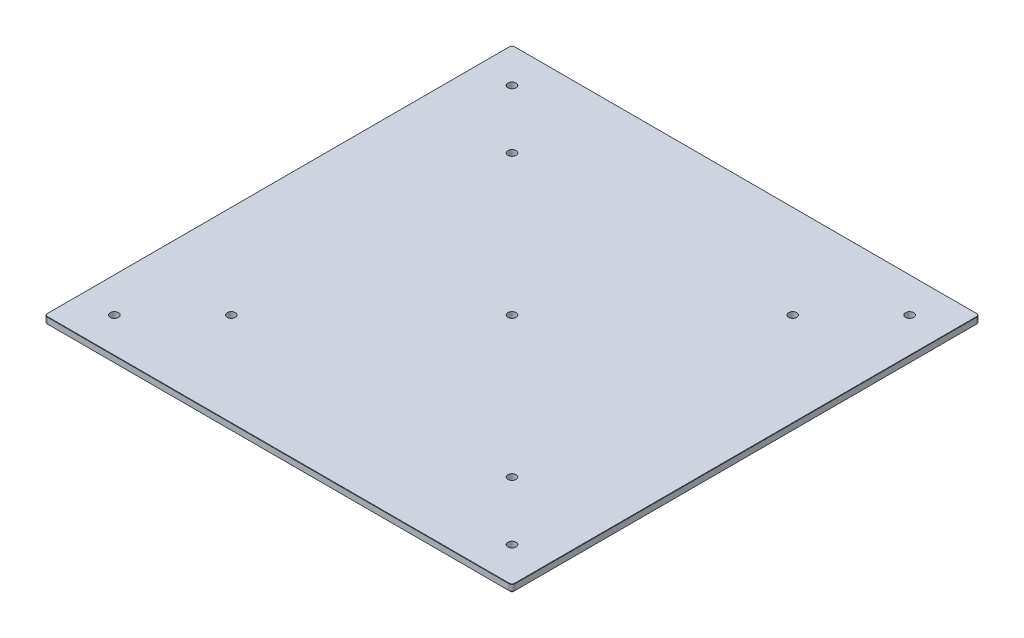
ISO-10303-21;
HEADER;
FILE_DESCRIPTION(('STEP AP214'),'2;1');
FILE_NAME('part.step','',(''),(''),'','','');
FILE_SCHEMA(('AUTOMOTIVE_DESIGN { 1 0 10303 214 1 1 1 1 }'));
ENDSEC;
DATA;
#1=APPLICATION_CONTEXT('core data for automotive mechanical design processes');
#2=APPLICATION_PROTOCOL_DEFINITION('international standard','automotive_design',2000,#1);
#3=PRODUCT_CONTEXT('',#1,'mechanical');
#4=PRODUCT('Part','Part','',(#3));
#5=PRODUCT_RELATED_PRODUCT_CATEGORY('part','',(#4));
#6=PRODUCT_DEFINITION_FORMATION('','',#4);
#7=PRODUCT_DEFINITION_CONTEXT('part definition',#1,'design');
#8=PRODUCT_DEFINITION('design','',#6,#7);
#9=PRODUCT_DEFINITION_SHAPE('','',#8);
#10=(LENGTH_UNIT() NAMED_UNIT(*) SI_UNIT(.MILLI.,.METRE.));
#11=(NAMED_UNIT(*) PLANE_ANGLE_UNIT() SI_UNIT($,.RADIAN.));
#12=(NAMED_UNIT(*) SI_UNIT($,.STERADIAN.) SOLID_ANGLE_UNIT());
#13=UNCERTAINTY_MEASURE_WITH_UNIT(LENGTH_MEASURE(1.E-05),#10,'distance_accuracy_value','');
#14=(GEOMETRIC_REPRESENTATION_CONTEXT(3) GLOBAL_UNCERTAINTY_ASSIGNED_CONTEXT((#13)) GLOBAL_UNIT_ASSIGNED_CONTEXT((#10,
#11,#12)) REPRESENTATION_CONTEXT('',''));
#15=CARTESIAN_POINT('',(0.,0.,0.));
#16=DIRECTION('',(0.,0.,1.));
#17=DIRECTION('',(1.,0.,0.));
#18=AXIS2_PLACEMENT_3D('',#15,#16,#17);
#19=CARTESIAN_POINT('',(190.5,-6.35,-190.5));
#20=DIRECTION('',(0.,-1.,0.));
#21=DIRECTION('',(0.,0.,-1.));
#22=AXIS2_PLACEMENT_3D('',#19,#20,#21);
#23=PLANE('',#22);
#24=CARTESIAN_POINT('',(-161.925,-6.35,-161.925));
#25=DIRECTION('',(0.,1.,0.));
#26=DIRECTION('',(0.,0.,1.));
#27=AXIS2_PLACEMENT_3D('',#24,#25,#26);
#28=CIRCLE('',#27,3.3782);
#29=CARTESIAN_POINT('',(-161.925,-6.35,-158.5468));
#30=VERTEX_POINT('',#29);
#31=EDGE_CURVE('E724',#30,#30,#28,.T.);
#32=ORIENTED_EDGE('',*,*,#31,.T.);
#33=EDGE_LOOP('',(#32));
#34=FACE_BOUND('',#33,.T.);
#35=CARTESIAN_POINT('',(161.925,-6.35,-161.925));
#36=DIRECTION('',(0.,1.,0.));
#37=DIRECTION('',(0.,0.,1.));
#38=AXIS2_PLACEMENT_3D('',#35,#36,#37);
#39=CIRCLE('',#38,3.3782);
#40=CARTESIAN_POINT('',(161.925,-6.35,-158.5468));
#41=VERTEX_POINT('',#40);
#42=EDGE_CURVE('E716',#41,#41,#39,.T.);
#43=ORIENTED_EDGE('',*,*,#42,.T.);
#44=EDGE_LOOP('',(#43));
#45=FACE_BOUND('',#44,.T.);
#46=CARTESIAN_POINT('',(-187.96,-6.35,-187.96));
#47=DIRECTION('',(0.,-1.,0.));
#48=DIRECTION('',(0.,0.,-1.));
#49=AXIS2_PLACEMENT_3D('',#46,#47,#48);
#50=CIRCLE('',#49,1.27000000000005);
#51=CARTESIAN_POINT('',(-189.23,-6.35,-187.96));
#52=VERTEX_POINT('',#51);
#53=CARTESIAN_POINT('',(-187.96,-6.35,-189.23));
#54=VERTEX_POINT('',#53);
#55=EDGE_CURVE('E202',#52,#54,#50,.T.);
#56=ORIENTED_EDGE('',*,*,#55,.T.);
#57=DIRECTION('',(1.,0.,0.));
#58=VECTOR('',#57,1.);
#59=CARTESIAN_POINT('',(190.5,-6.35,-189.23));
#60=LINE('',#59,#58);
#61=CARTESIAN_POINT('',(187.96,-6.35,-189.23));
#62=VERTEX_POINT('',#61);
#63=EDGE_CURVE('E204',#54,#62,#60,.T.);
#64=ORIENTED_EDGE('',*,*,#63,.T.);
#65=CARTESIAN_POINT('',(187.96,-6.35,-187.96));
#66=DIRECTION('',(0.,-1.,0.));
#67=DIRECTION('',(0.,0.,-1.));
#68=AXIS2_PLACEMENT_3D('',#65,#66,#67);
#69=CIRCLE('',#68,1.27000000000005);
#70=CARTESIAN_POINT('',(189.23,-6.35,-187.96));
#71=VERTEX_POINT('',#70);
#72=EDGE_CURVE('E176',#62,#71,#69,.T.);
#73=ORIENTED_EDGE('',*,*,#72,.T.);
#74=DIRECTION('',(0.,0.,1.));
#75=VECTOR('',#74,1.);
#76=CARTESIAN_POINT('',(189.23,-6.35,-190.5));
#77=LINE('',#76,#75);
#78=CARTESIAN_POINT('',(189.23,-6.35,187.96));
#79=VERTEX_POINT('',#78);
#80=EDGE_CURVE('E197',#71,#79,#77,.T.);
#81=ORIENTED_EDGE('',*,*,#80,.T.);
#82=CARTESIAN_POINT('',(187.96,-6.35,187.96));
#83=DIRECTION('',(0.,-1.,0.));
#84=DIRECTION('',(0.,0.,-1.));
#85=AXIS2_PLACEMENT_3D('',#82,#83,#84);
#86=CIRCLE('',#85,1.27000000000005);
#87=CARTESIAN_POINT('',(187.96,-6.35,189.23));
#88=VERTEX_POINT('',#87);
#89=EDGE_CURVE('E189',#79,#88,#86,.T.);
#90=ORIENTED_EDGE('',*,*,#89,.T.);
#91=DIRECTION('',(-1.,0.,0.));
#92=VECTOR('',#91,1.);
#93=CARTESIAN_POINT('',(190.5,-6.35,189.23));
#94=LINE('',#93,#92);
#95=CARTESIAN_POINT('',(-187.96,-6.35,189.23));
#96=VERTEX_POINT('',#95);
#97=EDGE_CURVE('E186',#88,#96,#94,.T.);
#98=ORIENTED_EDGE('',*,*,#97,.T.);
#99=CARTESIAN_POINT('',(-187.96,-6.35,187.96));
#100=DIRECTION('',(0.,-1.,0.));
#101=DIRECTION('',(0.,0.,-1.));
#102=AXIS2_PLACEMENT_3D('',#99,#100,#101);
#103=CIRCLE('',#102,1.27000000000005);
#104=CARTESIAN_POINT('',(-189.23,-6.35,187.96));
#105=VERTEX_POINT('',#104);
#106=EDGE_CURVE('E195',#96,#105,#103,.T.);
#107=ORIENTED_EDGE('',*,*,#106,.T.);
#108=DIRECTION('',(0.,0.,-1.));
#109=VECTOR('',#108,1.);
#110=CARTESIAN_POINT('',(-189.23,-6.35,-190.5));
#111=LINE('',#110,#109);
#112=EDGE_CURVE('E199',#105,#52,#111,.T.);
#113=ORIENTED_EDGE('',*,*,#112,.T.);
#114=EDGE_LOOP('',(#56,#64,#73,#81,#90,#98,#107,#113));
#115=FACE_BOUND('',#114,.T.);
#116=CARTESIAN_POINT('',(0.,-6.35,0.));
#117=DIRECTION('',(0.,-1.,0.));
#118=DIRECTION('',(0.,0.,-1.));
#119=AXIS2_PLACEMENT_3D('',#116,#117,#118);
#120=CIRCLE('',#119,3.3782);
#121=CARTESIAN_POINT('',(0.,-6.35,-3.3782));
#122=VERTEX_POINT('',#121);
#123=EDGE_CURVE('E322',#122,#122,#120,.T.);
#124=ORIENTED_EDGE('',*,*,#123,.F.);
#125=EDGE_LOOP('',(#124));
#126=FACE_BOUND('',#125,.T.);
#127=CARTESIAN_POINT('',(-114.3,-6.35,-114.3));
#128=DIRECTION('',(0.,-1.,0.));
#129=DIRECTION('',(0.,0.,-1.));
#130=AXIS2_PLACEMENT_3D('',#127,#128,#129);
#131=CIRCLE('',#130,3.3782);
#132=CARTESIAN_POINT('',(-114.3,-6.35,-117.6782));
#133=VERTEX_POINT('',#132);
#134=EDGE_CURVE('E316',#133,#133,#131,.T.);
#135=ORIENTED_EDGE('',*,*,#134,.F.);
#136=EDGE_LOOP('',(#135));
#137=FACE_BOUND('',#136,.T.);
#138=CARTESIAN_POINT('',(-114.3,-6.35,114.3));
#139=DIRECTION('',(0.,-1.,0.));
#140=DIRECTION('',(0.,0.,-1.));
#141=AXIS2_PLACEMENT_3D('',#138,#139,#140);
#142=CIRCLE('',#141,3.3782);
#143=CARTESIAN_POINT('',(-114.3,-6.35,110.9218));
#144=VERTEX_POINT('',#143);
#145=EDGE_CURVE('E310',#144,#144,#142,.T.);
#146=ORIENTED_EDGE('',*,*,#145,.F.);
#147=EDGE_LOOP('',(#146));
#148=FACE_BOUND('',#147,.T.);
#149=CARTESIAN_POINT('',(114.3,-6.35,-114.3));
#150=DIRECTION('',(0.,-1.,0.));
#151=DIRECTION('',(0.,0.,-1.));
#152=AXIS2_PLACEMENT_3D('',#149,#150,#151);
#153=CIRCLE('',#152,3.3782);
#154=CARTESIAN_POINT('',(114.3,-6.35,-117.6782));
#155=VERTEX_POINT('',#154);
#156=EDGE_CURVE('E300',#155,#155,#153,.T.);
#157=ORIENTED_EDGE('',*,*,#156,.F.);
#158=EDGE_LOOP('',(#157));
#159=FACE_BOUND('',#158,.T.);
#160=CARTESIAN_POINT('',(114.3,-6.35,114.3));
#161=DIRECTION('',(0.,-1.,0.));
#162=DIRECTION('',(0.,0.,-1.));
#163=AXIS2_PLACEMENT_3D('',#160,#161,#162);
#164=CIRCLE('',#163,3.3782);
#165=CARTESIAN_POINT('',(114.3,-6.35,110.9218));
#166=VERTEX_POINT('',#165);
#167=EDGE_CURVE('E290',#166,#166,#164,.T.);
#168=ORIENTED_EDGE('',*,*,#167,.F.);
#169=EDGE_LOOP('',(#168));
#170=FACE_BOUND('',#169,.T.);
#171=CARTESIAN_POINT('',(-161.925,-6.35,161.925));
#172=DIRECTION('',(0.,1.,0.));
#173=DIRECTION('',(0.,0.,1.));
#174=AXIS2_PLACEMENT_3D('',#171,#172,#173);
#175=CIRCLE('',#174,3.3782);
#176=CARTESIAN_POINT('',(-161.925,-6.35,165.3032));
#177=VERTEX_POINT('',#176);
#178=EDGE_CURVE('E270',#177,#177,#175,.T.);
#179=ORIENTED_EDGE('',*,*,#178,.T.);
#180=EDGE_LOOP('',(#179));
#181=FACE_BOUND('',#180,.T.);
#182=CARTESIAN_POINT('',(161.925,-6.35,161.925));
#183=DIRECTION('',(0.,1.,0.));
#184=DIRECTION('',(0.,0.,1.));
#185=AXIS2_PLACEMENT_3D('',#182,#183,#184);
#186=CIRCLE('',#185,3.3782);
#187=CARTESIAN_POINT('',(161.925,-6.35,165.3032));
#188=VERTEX_POINT('',#187);
#189=EDGE_CURVE('E710',#188,#188,#186,.T.);
#190=ORIENTED_EDGE('',*,*,#189,.T.);
#191=EDGE_LOOP('',(#190));
#192=FACE_BOUND('',#191,.T.);
#193=ADVANCED_FACE('F32',(#34,#45,#115,#126,#137,#148,#159,#170,#181,#192),#23,.T.);
#194=CARTESIAN_POINT('',(190.5,-6.35,190.5));
#195=DIRECTION('',(1.,0.,0.));
#196=DIRECTION('',(0.,0.,-1.));
#197=AXIS2_PLACEMENT_3D('',#194,#195,#196);
#198=PLANE('',#197);
#199=DIRECTION('',(0.,1.,0.));
#200=VECTOR('',#199,1.);
#201=CARTESIAN_POINT('',(190.5,-6.35,-187.96));
#202=LINE('',#201,#200);
#203=CARTESIAN_POINT('',(190.5,-5.08000000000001,-187.96));
#204=VERTEX_POINT('',#203);
#205=CARTESIAN_POINT('',(190.5,-0.254000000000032,-187.96));
#206=VERTEX_POINT('',#205);
#207=EDGE_CURVE('E166',#204,#206,#202,.T.);
#208=ORIENTED_EDGE('',*,*,#207,.T.);
#209=DIRECTION('',(0.,0.,1.));
#210=VECTOR('',#209,1.);
#211=CARTESIAN_POINT('',(190.5,-0.254000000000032,187.96));
#212=LINE('',#211,#210);
#213=CARTESIAN_POINT('',(190.5,-0.254000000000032,187.96));
#214=VERTEX_POINT('',#213);
#215=EDGE_CURVE('E262',#206,#214,#212,.T.);
#216=ORIENTED_EDGE('',*,*,#215,.T.);
#217=DIRECTION('',(0.,1.,0.));
#218=VECTOR('',#217,1.);
#219=CARTESIAN_POINT('',(190.5,-6.35,187.96));
#220=LINE('',#219,#218);
#221=CARTESIAN_POINT('',(190.5,-5.08000000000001,187.96));
#222=VERTEX_POINT('',#221);
#223=EDGE_CURVE('E331',#214,#222,#220,.F.);
#224=ORIENTED_EDGE('',*,*,#223,.T.);
#225=DIRECTION('',(0.,0.,-1.));
#226=VECTOR('',#225,1.);
#227=CARTESIAN_POINT('',(190.5,-5.08000000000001,190.5));
#228=LINE('',#227,#226);
#229=EDGE_CURVE('E209',#222,#204,#228,.T.);
#230=ORIENTED_EDGE('',*,*,#229,.T.);
#231=EDGE_LOOP('',(#208,#216,#224,#230));
#232=FACE_BOUND('',#231,.T.);
#233=ADVANCED_FACE('F366',(#232),#198,.T.);
#234=CARTESIAN_POINT('',(-190.5,-6.35,190.5));
#235=DIRECTION('',(0.,0.,1.));
#236=DIRECTION('',(1.,0.,0.));
#237=AXIS2_PLACEMENT_3D('',#234,#235,#236);
#238=PLANE('',#237);
#239=DIRECTION('',(0.,1.,0.));
#240=VECTOR('',#239,1.);
#241=CARTESIAN_POINT('',(187.96,-6.35,190.5));
#242=LINE('',#241,#240);
#243=CARTESIAN_POINT('',(187.96,-5.08000000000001,190.5));
#244=VERTEX_POINT('',#243);
#245=CARTESIAN_POINT('',(187.96,-0.254000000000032,190.5));
#246=VERTEX_POINT('',#245);
#247=EDGE_CURVE('E328',#244,#246,#242,.T.);
#248=ORIENTED_EDGE('',*,*,#247,.T.);
#249=DIRECTION('',(-1.,0.,0.));
#250=VECTOR('',#249,1.);
#251=CARTESIAN_POINT('',(-187.96,-0.254000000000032,190.5));
#252=LINE('',#251,#250);
#253=CARTESIAN_POINT('',(-187.96,-0.254000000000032,190.5));
#254=VERTEX_POINT('',#253);
#255=EDGE_CURVE('E11',#246,#254,#252,.T.);
#256=ORIENTED_EDGE('',*,*,#255,.T.);
#257=DIRECTION('',(0.,1.,0.));
#258=VECTOR('',#257,1.);
#259=CARTESIAN_POINT('',(-187.96,-6.35,190.5));
#260=LINE('',#259,#258);
#261=CARTESIAN_POINT('',(-187.96,-5.08000000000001,190.5));
#262=VERTEX_POINT('',#261);
#263=EDGE_CURVE('E238',#254,#262,#260,.F.);
#264=ORIENTED_EDGE('',*,*,#263,.T.);
#265=DIRECTION('',(1.,0.,0.));
#266=VECTOR('',#265,1.);
#267=CARTESIAN_POINT('',(-190.5,-5.08000000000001,190.5));
#268=LINE('',#267,#266);
#269=EDGE_CURVE('E217',#262,#244,#268,.T.);
#270=ORIENTED_EDGE('',*,*,#269,.T.);
#271=EDGE_LOOP('',(#248,#256,#264,#270));
#272=FACE_BOUND('',#271,.T.);
#273=ADVANCED_FACE('F393',(#272),#238,.T.);
#274=CARTESIAN_POINT('',(-190.5,-6.35,190.5));
#275=DIRECTION('',(-1.,0.,0.));
#276=DIRECTION('',(0.,0.,1.));
#277=AXIS2_PLACEMENT_3D('',#274,#275,#276);
#278=PLANE('',#277);
#279=DIRECTION('',(0.,1.,0.));
#280=VECTOR('',#279,1.);
#281=CARTESIAN_POINT('',(-190.5,-6.35,187.96));
#282=LINE('',#281,#280);
#283=CARTESIAN_POINT('',(-190.5,-5.08000000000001,187.96));
#284=VERTEX_POINT('',#283);
#285=CARTESIAN_POINT('',(-190.5,-0.254000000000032,187.96));
#286=VERTEX_POINT('',#285);
#287=EDGE_CURVE('E157',#284,#286,#282,.T.);
#288=ORIENTED_EDGE('',*,*,#287,.T.);
#289=DIRECTION('',(0.,0.,-1.));
#290=VECTOR('',#289,1.);
#291=CARTESIAN_POINT('',(-190.5,-0.254000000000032,-187.96));
#292=LINE('',#291,#290);
#293=CARTESIAN_POINT('',(-190.5,-0.254000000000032,-187.96));
#294=VERTEX_POINT('',#293);
#295=EDGE_CURVE('E260',#286,#294,#292,.T.);
#296=ORIENTED_EDGE('',*,*,#295,.T.);
#297=DIRECTION('',(0.,1.,0.));
#298=VECTOR('',#297,1.);
#299=CARTESIAN_POINT('',(-190.5,-6.35,-187.96));
#300=LINE('',#299,#298);
#301=CARTESIAN_POINT('',(-190.5,-5.08000000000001,-187.96));
#302=VERTEX_POINT('',#301);
#303=EDGE_CURVE('E187',#294,#302,#300,.F.);
#304=ORIENTED_EDGE('',*,*,#303,.T.);
#305=DIRECTION('',(0.,0.,1.));
#306=VECTOR('',#305,1.);
#307=CARTESIAN_POINT('',(-190.5,-5.08000000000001,190.5));
#308=LINE('',#307,#306);
#309=EDGE_CURVE('E170',#302,#284,#308,.T.);
#310=ORIENTED_EDGE('',*,*,#309,.T.);
#311=EDGE_LOOP('',(#288,#296,#304,#310));
#312=FACE_BOUND('',#311,.T.);
#313=ADVANCED_FACE('F337',(#312),#278,.T.);
#314=CARTESIAN_POINT('',(-190.5,-6.35,-190.5));
#315=DIRECTION('',(0.,0.,-1.));
#316=DIRECTION('',(-1.,0.,0.));
#317=AXIS2_PLACEMENT_3D('',#314,#315,#316);
#318=PLANE('',#317);
#319=DIRECTION('',(0.,1.,0.));
#320=VECTOR('',#319,1.);
#321=CARTESIAN_POINT('',(-187.96,-6.35,-190.5));
#322=LINE('',#321,#320);
#323=CARTESIAN_POINT('',(-187.96,-5.08000000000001,-190.5));
#324=VERTEX_POINT('',#323);
#325=CARTESIAN_POINT('',(-187.96,-0.254000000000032,-190.5));
#326=VERTEX_POINT('',#325);
#327=EDGE_CURVE('E158',#324,#326,#322,.T.);
#328=ORIENTED_EDGE('',*,*,#327,.T.);
#329=DIRECTION('',(1.,0.,0.));
#330=VECTOR('',#329,1.);
#331=CARTESIAN_POINT('',(187.96,-0.254000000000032,-190.5));
#332=LINE('',#331,#330);
#333=CARTESIAN_POINT('',(187.96,-0.254000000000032,-190.5));
#334=VERTEX_POINT('',#333);
#335=EDGE_CURVE('E155',#326,#334,#332,.T.);
#336=ORIENTED_EDGE('',*,*,#335,.T.);
#337=DIRECTION('',(0.,1.,0.));
#338=VECTOR('',#337,1.);
#339=CARTESIAN_POINT('',(187.96,-6.35,-190.5));
#340=LINE('',#339,#338);
#341=CARTESIAN_POINT('',(187.96,-5.08000000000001,-190.5));
#342=VERTEX_POINT('',#341);
#343=EDGE_CURVE('E147',#334,#342,#340,.F.);
#344=ORIENTED_EDGE('',*,*,#343,.T.);
#345=DIRECTION('',(-1.,0.,0.));
#346=VECTOR('',#345,1.);
#347=CARTESIAN_POINT('',(-190.5,-5.08000000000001,-190.5));
#348=LINE('',#347,#346);
#349=EDGE_CURVE('E152',#342,#324,#348,.T.);
#350=ORIENTED_EDGE('',*,*,#349,.T.);
#351=EDGE_LOOP('',(#328,#336,#344,#350));
#352=FACE_BOUND('',#351,.T.);
#353=ADVANCED_FACE('F150',(#352),#318,.T.);
#354=CARTESIAN_POINT('',(190.5,0.,-190.5));
#355=DIRECTION('',(0.,-1.,0.));
#356=DIRECTION('',(0.,0.,-1.));
#357=AXIS2_PLACEMENT_3D('',#354,#355,#356);
#358=PLANE('',#357);
#359=CARTESIAN_POINT('',(-161.925,0.,-161.925));
#360=DIRECTION('',(0.,1.,0.));
#361=DIRECTION('',(0.,0.,1.));
#362=AXIS2_PLACEMENT_3D('',#359,#360,#361);
#363=CIRCLE('',#362,3.3782);
#364=CARTESIAN_POINT('',(-161.925,0.,-158.5468));
#365=VERTEX_POINT('',#364);
#366=EDGE_CURVE('E726',#365,#365,#363,.T.);
#367=ORIENTED_EDGE('',*,*,#366,.F.);
#368=EDGE_LOOP('',(#367));
#369=FACE_BOUND('',#368,.T.);
#370=CARTESIAN_POINT('',(161.925,0.,-161.925));
#371=DIRECTION('',(0.,1.,0.));
#372=DIRECTION('',(0.,0.,1.));
#373=AXIS2_PLACEMENT_3D('',#370,#371,#372);
#374=CIRCLE('',#373,3.3782);
#375=CARTESIAN_POINT('',(161.925,0.,-158.5468));
#376=VERTEX_POINT('',#375);
#377=EDGE_CURVE('E721',#376,#376,#374,.T.);
#378=ORIENTED_EDGE('',*,*,#377,.F.);
#379=EDGE_LOOP('',(#378));
#380=FACE_BOUND('',#379,.T.);
#381=CARTESIAN_POINT('',(161.925,0.,161.925));
#382=DIRECTION('',(0.,1.,0.));
#383=DIRECTION('',(0.,0.,1.));
#384=AXIS2_PLACEMENT_3D('',#381,#382,#383);
#385=CIRCLE('',#384,3.3782);
#386=CARTESIAN_POINT('',(161.925,0.,165.3032));
#387=VERTEX_POINT('',#386);
#388=EDGE_CURVE('E712',#387,#387,#385,.T.);
#389=ORIENTED_EDGE('',*,*,#388,.F.);
#390=EDGE_LOOP('',(#389));
#391=FACE_BOUND('',#390,.T.);
#392=CARTESIAN_POINT('',(-161.925,0.,161.925));
#393=DIRECTION('',(0.,1.,0.));
#394=DIRECTION('',(0.,0.,1.));
#395=AXIS2_PLACEMENT_3D('',#392,#393,#394);
#396=CIRCLE('',#395,3.3782);
#397=CARTESIAN_POINT('',(-161.925,0.,165.3032));
#398=VERTEX_POINT('',#397);
#399=EDGE_CURVE('E711',#398,#398,#396,.T.);
#400=ORIENTED_EDGE('',*,*,#399,.F.);
#401=EDGE_LOOP('',(#400));
#402=FACE_BOUND('',#401,.T.);
#403=CARTESIAN_POINT('',(187.96,0.,-187.96));
#404=DIRECTION('',(0.,-1.,0.));
#405=DIRECTION('',(0.,0.,-1.));
#406=AXIS2_PLACEMENT_3D('',#403,#404,#405);
#407=CIRCLE('',#406,2.2859999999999);
#408=CARTESIAN_POINT('',(190.246,0.,-187.96));
#409=VERTEX_POINT('',#408);
#410=CARTESIAN_POINT('',(187.96,0.,-190.246));
#411=VERTEX_POINT('',#410);
#412=EDGE_CURVE('E248',#409,#411,#407,.F.);
#413=ORIENTED_EDGE('',*,*,#412,.T.);
#414=DIRECTION('',(-1.,0.,0.));
#415=VECTOR('',#414,1.);
#416=CARTESIAN_POINT('',(-187.96,0.,-190.246));
#417=LINE('',#416,#415);
#418=CARTESIAN_POINT('',(-187.96,0.,-190.246));
#419=VERTEX_POINT('',#418);
#420=EDGE_CURVE('E252',#411,#419,#417,.T.);
#421=ORIENTED_EDGE('',*,*,#420,.T.);
#422=CARTESIAN_POINT('',(-187.96,0.,-187.96));
#423=DIRECTION('',(0.,-1.,0.));
#424=DIRECTION('',(0.,0.,-1.));
#425=AXIS2_PLACEMENT_3D('',#422,#423,#424);
#426=CIRCLE('',#425,2.2859999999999);
#427=CARTESIAN_POINT('',(-190.246,0.,-187.96));
#428=VERTEX_POINT('',#427);
#429=EDGE_CURVE('E250',#419,#428,#426,.F.);
#430=ORIENTED_EDGE('',*,*,#429,.T.);
#431=DIRECTION('',(0.,0.,1.));
#432=VECTOR('',#431,1.);
#433=CARTESIAN_POINT('',(-190.246,0.,187.96));
#434=LINE('',#433,#432);
#435=CARTESIAN_POINT('',(-190.246,0.,187.96));
#436=VERTEX_POINT('',#435);
#437=EDGE_CURVE('E246',#428,#436,#434,.T.);
#438=ORIENTED_EDGE('',*,*,#437,.T.);
#439=CARTESIAN_POINT('',(-187.96,0.,187.96));
#440=DIRECTION('',(0.,-1.,0.));
#441=DIRECTION('',(0.,0.,-1.));
#442=AXIS2_PLACEMENT_3D('',#439,#440,#441);
#443=CIRCLE('',#442,2.2859999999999);
#444=CARTESIAN_POINT('',(-187.96,0.,190.246));
#445=VERTEX_POINT('',#444);
#446=EDGE_CURVE('E242',#436,#445,#443,.F.);
#447=ORIENTED_EDGE('',*,*,#446,.T.);
#448=DIRECTION('',(1.,0.,0.));
#449=VECTOR('',#448,1.);
#450=CARTESIAN_POINT('',(187.96,0.,190.246));
#451=LINE('',#450,#449);
#452=CARTESIAN_POINT('',(187.96,0.,190.246));
#453=VERTEX_POINT('',#452);
#454=EDGE_CURVE('E219',#445,#453,#451,.T.);
#455=ORIENTED_EDGE('',*,*,#454,.T.);
#456=CARTESIAN_POINT('',(187.96,0.,187.96));
#457=DIRECTION('',(0.,-1.,0.));
#458=DIRECTION('',(0.,0.,-1.));
#459=AXIS2_PLACEMENT_3D('',#456,#457,#458);
#460=CIRCLE('',#459,2.2859999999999);
#461=CARTESIAN_POINT('',(190.246,0.,187.96));
#462=VERTEX_POINT('',#461);
#463=EDGE_CURVE('E240',#453,#462,#460,.F.);
#464=ORIENTED_EDGE('',*,*,#463,.T.);
#465=DIRECTION('',(0.,0.,-1.));
#466=VECTOR('',#465,1.);
#467=CARTESIAN_POINT('',(190.246,0.,-187.96));
#468=LINE('',#467,#466);
#469=EDGE_CURVE('E244',#462,#409,#468,.T.);
#470=ORIENTED_EDGE('',*,*,#469,.T.);
#471=EDGE_LOOP('',(#413,#421,#430,#438,#447,#455,#464,#470));
#472=FACE_BOUND('',#471,.T.);
#473=CARTESIAN_POINT('',(114.3,0.,114.3));
#474=DIRECTION('',(0.,-1.,0.));
#475=DIRECTION('',(0.,0.,-1.));
#476=AXIS2_PLACEMENT_3D('',#473,#474,#475);
#477=CIRCLE('',#476,3.3782);
#478=CARTESIAN_POINT('',(114.3,0.,110.9218));
#479=VERTEX_POINT('',#478);
#480=EDGE_CURVE('E295',#479,#479,#477,.T.);
#481=ORIENTED_EDGE('',*,*,#480,.T.);
#482=EDGE_LOOP('',(#481));
#483=FACE_BOUND('',#482,.T.);
#484=CARTESIAN_POINT('',(114.3,0.,-114.3));
#485=DIRECTION('',(0.,-1.,0.));
#486=DIRECTION('',(0.,0.,-1.));
#487=AXIS2_PLACEMENT_3D('',#484,#485,#486);
#488=CIRCLE('',#487,3.3782);
#489=CARTESIAN_POINT('',(114.3,0.,-117.6782));
#490=VERTEX_POINT('',#489);
#491=EDGE_CURVE('E307',#490,#490,#488,.T.);
#492=ORIENTED_EDGE('',*,*,#491,.T.);
#493=EDGE_LOOP('',(#492));
#494=FACE_BOUND('',#493,.T.);
#495=CARTESIAN_POINT('',(-114.3,0.,114.3));
#496=DIRECTION('',(0.,-1.,0.));
#497=DIRECTION('',(0.,0.,-1.));
#498=AXIS2_PLACEMENT_3D('',#495,#496,#497);
#499=CIRCLE('',#498,3.3782);
#500=CARTESIAN_POINT('',(-114.3,0.,110.9218));
#501=VERTEX_POINT('',#500);
#502=EDGE_CURVE('E313',#501,#501,#499,.T.);
#503=ORIENTED_EDGE('',*,*,#502,.T.);
#504=EDGE_LOOP('',(#503));
#505=FACE_BOUND('',#504,.T.);
#506=CARTESIAN_POINT('',(-114.3,0.,-114.3));
#507=DIRECTION('',(0.,-1.,0.));
#508=DIRECTION('',(0.,0.,-1.));
#509=AXIS2_PLACEMENT_3D('',#506,#507,#508);
#510=CIRCLE('',#509,3.3782);
#511=CARTESIAN_POINT('',(-114.3,0.,-117.6782));
#512=VERTEX_POINT('',#511);
#513=EDGE_CURVE('E319',#512,#512,#510,.T.);
#514=ORIENTED_EDGE('',*,*,#513,.T.);
#515=EDGE_LOOP('',(#514));
#516=FACE_BOUND('',#515,.T.);
#517=CARTESIAN_POINT('',(0.,0.,0.));
#518=DIRECTION('',(0.,-1.,0.));
#519=DIRECTION('',(0.,0.,-1.));
#520=AXIS2_PLACEMENT_3D('',#517,#518,#519);
#521=CIRCLE('',#520,3.3782);
#522=CARTESIAN_POINT('',(0.,0.,-3.3782));
#523=VERTEX_POINT('',#522);
#524=EDGE_CURVE('E220',#523,#523,#521,.T.);
#525=ORIENTED_EDGE('',*,*,#524,.T.);
#526=EDGE_LOOP('',(#525));
#527=FACE_BOUND('',#526,.T.);
#528=ADVANCED_FACE('F374',(#369,#380,#391,#402,#472,#483,#494,#505,#516,#527),#358,.F.);
#529=CARTESIAN_POINT('',(187.96,-6.35,187.96));
#530=DIRECTION('',(0.,1.,0.));
#531=DIRECTION('',(0.,0.,1.));
#532=AXIS2_PLACEMENT_3D('',#529,#530,#531);
#533=CYLINDRICAL_SURFACE('',#532,2.54);
#534=ORIENTED_EDGE('',*,*,#223,.F.);
#535=CARTESIAN_POINT('',(187.96,-0.254000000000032,187.96));
#536=DIRECTION('',(0.,-1.,0.));
#537=DIRECTION('',(0.,0.,-1.));
#538=AXIS2_PLACEMENT_3D('',#535,#536,#537);
#539=CIRCLE('',#538,2.54);
#540=EDGE_CURVE('E41',#214,#246,#539,.T.);
#541=ORIENTED_EDGE('',*,*,#540,.T.);
#542=ORIENTED_EDGE('',*,*,#247,.F.);
#543=CARTESIAN_POINT('',(187.96,-5.08000000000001,187.96));
#544=DIRECTION('',(0.,-1.,0.));
#545=DIRECTION('',(0.,0.,-1.));
#546=AXIS2_PLACEMENT_3D('',#543,#544,#545);
#547=CIRCLE('',#546,2.54);
#548=EDGE_CURVE('E214',#244,#222,#547,.F.);
#549=ORIENTED_EDGE('',*,*,#548,.T.);
#550=EDGE_LOOP('',(#534,#541,#542,#549));
#551=FACE_BOUND('',#550,.T.);
#552=ADVANCED_FACE('F403',(#551),#533,.T.);
#553=CARTESIAN_POINT('',(187.96,-6.35,-187.96));
#554=DIRECTION('',(0.,1.,0.));
#555=DIRECTION('',(0.,0.,1.));
#556=AXIS2_PLACEMENT_3D('',#553,#554,#555);
#557=CYLINDRICAL_SURFACE('',#556,2.54);
#558=ORIENTED_EDGE('',*,*,#343,.F.);
#559=CARTESIAN_POINT('',(187.96,-0.254000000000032,-187.96));
#560=DIRECTION('',(0.,-1.,0.));
#561=DIRECTION('',(0.,0.,-1.));
#562=AXIS2_PLACEMENT_3D('',#559,#560,#561);
#563=CIRCLE('',#562,2.54);
#564=EDGE_CURVE('E258',#334,#206,#563,.T.);
#565=ORIENTED_EDGE('',*,*,#564,.T.);
#566=ORIENTED_EDGE('',*,*,#207,.F.);
#567=CARTESIAN_POINT('',(187.96,-5.08000000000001,-187.96));
#568=DIRECTION('',(0.,-1.,0.));
#569=DIRECTION('',(0.,0.,-1.));
#570=AXIS2_PLACEMENT_3D('',#567,#568,#569);
#571=CIRCLE('',#570,2.54);
#572=EDGE_CURVE('E162',#204,#342,#571,.F.);
#573=ORIENTED_EDGE('',*,*,#572,.T.);
#574=EDGE_LOOP('',(#558,#565,#566,#573));
#575=FACE_BOUND('',#574,.T.);
#576=ADVANCED_FACE('F164',(#575),#557,.T.);
#577=CARTESIAN_POINT('',(-187.96,-6.35,-187.96));
#578=DIRECTION('',(0.,1.,0.));
#579=DIRECTION('',(0.,0.,1.));
#580=AXIS2_PLACEMENT_3D('',#577,#578,#579);
#581=CYLINDRICAL_SURFACE('',#580,2.54);
#582=ORIENTED_EDGE('',*,*,#303,.F.);
#583=CARTESIAN_POINT('',(-187.96,-0.254000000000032,-187.96));
#584=DIRECTION('',(0.,-1.,0.));
#585=DIRECTION('',(0.,0.,-1.));
#586=AXIS2_PLACEMENT_3D('',#583,#584,#585);
#587=CIRCLE('',#586,2.54);
#588=EDGE_CURVE('E256',#294,#326,#587,.T.);
#589=ORIENTED_EDGE('',*,*,#588,.T.);
#590=ORIENTED_EDGE('',*,*,#327,.F.);
#591=CARTESIAN_POINT('',(-187.96,-5.08000000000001,-187.96));
#592=DIRECTION('',(0.,-1.,0.));
#593=DIRECTION('',(0.,0.,-1.));
#594=AXIS2_PLACEMENT_3D('',#591,#592,#593);
#595=CIRCLE('',#594,2.54);
#596=EDGE_CURVE('E171',#324,#302,#595,.F.);
#597=ORIENTED_EDGE('',*,*,#596,.T.);
#598=EDGE_LOOP('',(#582,#589,#590,#597));
#599=FACE_BOUND('',#598,.T.);
#600=ADVANCED_FACE('F354',(#599),#581,.T.);
#601=CARTESIAN_POINT('',(-187.96,-6.35,187.96));
#602=DIRECTION('',(0.,1.,0.));
#603=DIRECTION('',(0.,0.,1.));
#604=AXIS2_PLACEMENT_3D('',#601,#602,#603);
#605=CYLINDRICAL_SURFACE('',#604,2.54);
#606=ORIENTED_EDGE('',*,*,#263,.F.);
#607=CARTESIAN_POINT('',(-187.96,-0.254000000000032,187.96));
#608=DIRECTION('',(0.,-1.,0.));
#609=DIRECTION('',(0.,0.,-1.));
#610=AXIS2_PLACEMENT_3D('',#607,#608,#609);
#611=CIRCLE('',#610,2.54);
#612=EDGE_CURVE('E264',#254,#286,#611,.T.);
#613=ORIENTED_EDGE('',*,*,#612,.T.);
#614=ORIENTED_EDGE('',*,*,#287,.F.);
#615=CARTESIAN_POINT('',(-187.96,-5.08000000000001,187.96));
#616=DIRECTION('',(0.,-1.,0.));
#617=DIRECTION('',(0.,0.,-1.));
#618=AXIS2_PLACEMENT_3D('',#615,#616,#617);
#619=CIRCLE('',#618,2.54);
#620=EDGE_CURVE('E211',#284,#262,#619,.F.);
#621=ORIENTED_EDGE('',*,*,#620,.T.);
#622=EDGE_LOOP('',(#606,#613,#614,#621));
#623=FACE_BOUND('',#622,.T.);
#624=ADVANCED_FACE('F417',(#623),#605,.T.);
#625=CARTESIAN_POINT('',(-190.5,-5.08000000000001,190.5));
#626=DIRECTION('',(0.,0.707106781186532,-0.707106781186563));
#627=DIRECTION('',(0.,0.707106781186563,0.707106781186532));
#628=AXIS2_PLACEMENT_3D('',#625,#626,#627);
#629=PLANE('',#628);
#630=DIRECTION('',(0.,0.707106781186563,0.707106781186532));
#631=VECTOR('',#630,1.);
#632=CARTESIAN_POINT('',(-187.96,-6.35,189.23));
#633=LINE('',#632,#631);
#634=EDGE_CURVE('E232',#96,#262,#633,.T.);
#635=ORIENTED_EDGE('',*,*,#634,.F.);
#636=ORIENTED_EDGE('',*,*,#97,.F.);
#637=DIRECTION('',(0.,-0.707106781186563,-0.707106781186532));
#638=VECTOR('',#637,1.);
#639=CARTESIAN_POINT('',(187.96,-5.08000000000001,190.5));
#640=LINE('',#639,#638);
#641=EDGE_CURVE('E235',#244,#88,#640,.T.);
#642=ORIENTED_EDGE('',*,*,#641,.F.);
#643=ORIENTED_EDGE('',*,*,#269,.F.);
#644=EDGE_LOOP('',(#635,#636,#642,#643));
#645=FACE_BOUND('',#644,.T.);
#646=ADVANCED_FACE('F420',(#645),#629,.F.);
#647=CARTESIAN_POINT('',(187.96,-6.35,187.96));
#648=DIRECTION('',(0.,1.,0.));
#649=DIRECTION('',(0.,0.,1.));
#650=AXIS2_PLACEMENT_3D('',#647,#648,#649);
#651=CONICAL_SURFACE('',#650,1.27000000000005,0.785398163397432);
#652=ORIENTED_EDGE('',*,*,#641,.T.);
#653=ORIENTED_EDGE('',*,*,#89,.F.);
#654=DIRECTION('',(-0.707106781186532,-0.707106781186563,0.));
#655=VECTOR('',#654,1.);
#656=CARTESIAN_POINT('',(190.5,-5.08000000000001,187.96));
#657=LINE('',#656,#655);
#658=EDGE_CURVE('E229',#222,#79,#657,.T.);
#659=ORIENTED_EDGE('',*,*,#658,.F.);
#660=ORIENTED_EDGE('',*,*,#548,.F.);
#661=EDGE_LOOP('',(#652,#653,#659,#660));
#662=FACE_BOUND('',#661,.T.);
#663=ADVANCED_FACE('F440',(#662),#651,.T.);
#664=CARTESIAN_POINT('',(-187.96,-6.35,187.96));
#665=DIRECTION('',(0.,1.,0.));
#666=DIRECTION('',(0.,0.,1.));
#667=AXIS2_PLACEMENT_3D('',#664,#665,#666);
#668=CONICAL_SURFACE('',#667,1.27000000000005,0.785398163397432);
#669=ORIENTED_EDGE('',*,*,#634,.T.);
#670=ORIENTED_EDGE('',*,*,#620,.F.);
#671=DIRECTION('',(-0.707106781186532,0.707106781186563,0.));
#672=VECTOR('',#671,1.);
#673=CARTESIAN_POINT('',(-189.23,-6.35,187.96));
#674=LINE('',#673,#672);
#675=EDGE_CURVE('E226',#105,#284,#674,.T.);
#676=ORIENTED_EDGE('',*,*,#675,.F.);
#677=ORIENTED_EDGE('',*,*,#106,.F.);
#678=EDGE_LOOP('',(#669,#670,#676,#677));
#679=FACE_BOUND('',#678,.T.);
#680=ADVANCED_FACE('F436',(#679),#668,.T.);
#681=CARTESIAN_POINT('',(190.5,-5.08000000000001,190.5));
#682=DIRECTION('',(-0.707106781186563,0.707106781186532,0.));
#683=DIRECTION('',(-0.707106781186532,-0.707106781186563,0.));
#684=AXIS2_PLACEMENT_3D('',#681,#682,#683);
#685=PLANE('',#684);
#686=ORIENTED_EDGE('',*,*,#658,.T.);
#687=ORIENTED_EDGE('',*,*,#80,.F.);
#688=DIRECTION('',(-0.707106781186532,-0.707106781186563,0.));
#689=VECTOR('',#688,1.);
#690=CARTESIAN_POINT('',(190.5,-5.08000000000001,-187.96));
#691=LINE('',#690,#689);
#692=EDGE_CURVE('E224',#204,#71,#691,.T.);
#693=ORIENTED_EDGE('',*,*,#692,.F.);
#694=ORIENTED_EDGE('',*,*,#229,.F.);
#695=EDGE_LOOP('',(#686,#687,#693,#694));
#696=FACE_BOUND('',#695,.T.);
#697=ADVANCED_FACE('F432',(#696),#685,.F.);
#698=CARTESIAN_POINT('',(-190.5,-5.08000000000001,190.5));
#699=DIRECTION('',(0.707106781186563,0.707106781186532,0.));
#700=DIRECTION('',(-0.707106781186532,0.707106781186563,0.));
#701=AXIS2_PLACEMENT_3D('',#698,#699,#700);
#702=PLANE('',#701);
#703=ORIENTED_EDGE('',*,*,#675,.T.);
#704=ORIENTED_EDGE('',*,*,#309,.F.);
#705=DIRECTION('',(-0.707106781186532,0.707106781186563,0.));
#706=VECTOR('',#705,1.);
#707=CARTESIAN_POINT('',(-189.23,-6.35,-187.96));
#708=LINE('',#707,#706);
#709=EDGE_CURVE('E180',#52,#302,#708,.T.);
#710=ORIENTED_EDGE('',*,*,#709,.F.);
#711=ORIENTED_EDGE('',*,*,#112,.F.);
#712=EDGE_LOOP('',(#703,#704,#710,#711));
#713=FACE_BOUND('',#712,.T.);
#714=ADVANCED_FACE('F429',(#713),#702,.F.);
#715=CARTESIAN_POINT('',(187.96,-6.35,-187.96));
#716=DIRECTION('',(0.,1.,0.));
#717=DIRECTION('',(0.,0.,1.));
#718=AXIS2_PLACEMENT_3D('',#715,#716,#717);
#719=CONICAL_SURFACE('',#718,1.27000000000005,0.785398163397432);
#720=ORIENTED_EDGE('',*,*,#692,.T.);
#721=ORIENTED_EDGE('',*,*,#72,.F.);
#722=DIRECTION('',(0.,-0.707106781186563,0.707106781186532));
#723=VECTOR('',#722,1.);
#724=CARTESIAN_POINT('',(187.96,-5.08000000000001,-190.5));
#725=LINE('',#724,#723);
#726=EDGE_CURVE('E174',#342,#62,#725,.T.);
#727=ORIENTED_EDGE('',*,*,#726,.F.);
#728=ORIENTED_EDGE('',*,*,#572,.F.);
#729=EDGE_LOOP('',(#720,#721,#727,#728));
#730=FACE_BOUND('',#729,.T.);
#731=ADVANCED_FACE('F175',(#730),#719,.T.);
#732=CARTESIAN_POINT('',(-187.96,-6.35,-187.96));
#733=DIRECTION('',(0.,1.,0.));
#734=DIRECTION('',(0.,0.,1.));
#735=AXIS2_PLACEMENT_3D('',#732,#733,#734);
#736=CONICAL_SURFACE('',#735,1.27000000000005,0.785398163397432);
#737=ORIENTED_EDGE('',*,*,#709,.T.);
#738=ORIENTED_EDGE('',*,*,#596,.F.);
#739=DIRECTION('',(0.,0.707106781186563,-0.707106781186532));
#740=VECTOR('',#739,1.);
#741=CARTESIAN_POINT('',(-187.96,-6.35,-189.23));
#742=LINE('',#741,#740);
#743=EDGE_CURVE('E181',#54,#324,#742,.T.);
#744=ORIENTED_EDGE('',*,*,#743,.F.);
#745=ORIENTED_EDGE('',*,*,#55,.F.);
#746=EDGE_LOOP('',(#737,#738,#744,#745));
#747=FACE_BOUND('',#746,.T.);
#748=ADVANCED_FACE('F423',(#747),#736,.T.);
#749=CARTESIAN_POINT('',(-190.5,-5.08000000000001,-190.5));
#750=DIRECTION('',(0.,0.707106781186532,0.707106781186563));
#751=DIRECTION('',(0.,-0.707106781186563,0.707106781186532));
#752=AXIS2_PLACEMENT_3D('',#749,#750,#751);
#753=PLANE('',#752);
#754=ORIENTED_EDGE('',*,*,#726,.T.);
#755=ORIENTED_EDGE('',*,*,#63,.F.);
#756=ORIENTED_EDGE('',*,*,#743,.T.);
#757=ORIENTED_EDGE('',*,*,#349,.F.);
#758=EDGE_LOOP('',(#754,#755,#756,#757));
#759=FACE_BOUND('',#758,.T.);
#760=ADVANCED_FACE('F183',(#759),#753,.F.);
#761=CARTESIAN_POINT('',(0.,-6.35,0.));
#762=DIRECTION('',(0.,-1.,0.));
#763=DIRECTION('',(0.,0.,-1.));
#764=AXIS2_PLACEMENT_3D('',#761,#762,#763);
#765=CYLINDRICAL_SURFACE('',#764,3.3782);
#766=ORIENTED_EDGE('',*,*,#524,.F.);
#767=EDGE_LOOP('',(#766));
#768=FACE_BOUND('',#767,.T.);
#769=ORIENTED_EDGE('',*,*,#123,.T.);
#770=EDGE_LOOP('',(#769));
#771=FACE_BOUND('',#770,.T.);
#772=ADVANCED_FACE('F399',(#768,#771),#765,.F.);
#773=CARTESIAN_POINT('',(-114.3,-6.35,-114.3));
#774=DIRECTION('',(0.,-1.,0.));
#775=DIRECTION('',(0.,0.,-1.));
#776=AXIS2_PLACEMENT_3D('',#773,#774,#775);
#777=CYLINDRICAL_SURFACE('',#776,3.3782);
#778=ORIENTED_EDGE('',*,*,#513,.F.);
#779=EDGE_LOOP('',(#778));
#780=FACE_BOUND('',#779,.T.);
#781=ORIENTED_EDGE('',*,*,#134,.T.);
#782=EDGE_LOOP('',(#781));
#783=FACE_BOUND('',#782,.T.);
#784=ADVANCED_FACE('F572',(#780,#783),#777,.F.);
#785=CARTESIAN_POINT('',(-114.3,-6.35,114.3));
#786=DIRECTION('',(0.,-1.,0.));
#787=DIRECTION('',(0.,0.,-1.));
#788=AXIS2_PLACEMENT_3D('',#785,#786,#787);
#789=CYLINDRICAL_SURFACE('',#788,3.3782);
#790=ORIENTED_EDGE('',*,*,#502,.F.);
#791=EDGE_LOOP('',(#790));
#792=FACE_BOUND('',#791,.T.);
#793=ORIENTED_EDGE('',*,*,#145,.T.);
#794=EDGE_LOOP('',(#793));
#795=FACE_BOUND('',#794,.T.);
#796=ADVANCED_FACE('F563',(#792,#795),#789,.F.);
#797=CARTESIAN_POINT('',(114.3,-6.35,-114.3));
#798=DIRECTION('',(0.,-1.,0.));
#799=DIRECTION('',(0.,0.,-1.));
#800=AXIS2_PLACEMENT_3D('',#797,#798,#799);
#801=CYLINDRICAL_SURFACE('',#800,3.3782);
#802=ORIENTED_EDGE('',*,*,#491,.F.);
#803=EDGE_LOOP('',(#802));
#804=FACE_BOUND('',#803,.T.);
#805=ORIENTED_EDGE('',*,*,#156,.T.);
#806=EDGE_LOOP('',(#805));
#807=FACE_BOUND('',#806,.T.);
#808=ADVANCED_FACE('F384',(#804,#807),#801,.F.);
#809=CARTESIAN_POINT('',(114.3,-6.35,114.3));
#810=DIRECTION('',(0.,-1.,0.));
#811=DIRECTION('',(0.,0.,-1.));
#812=AXIS2_PLACEMENT_3D('',#809,#810,#811);
#813=CYLINDRICAL_SURFACE('',#812,3.3782);
#814=ORIENTED_EDGE('',*,*,#480,.F.);
#815=EDGE_LOOP('',(#814));
#816=FACE_BOUND('',#815,.T.);
#817=ORIENTED_EDGE('',*,*,#167,.T.);
#818=EDGE_LOOP('',(#817));
#819=FACE_BOUND('',#818,.T.);
#820=ADVANCED_FACE('F379',(#816,#819),#813,.F.);
#821=CARTESIAN_POINT('',(190.5,0.,190.246));
#822=DIRECTION('',(0.,0.707106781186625,0.70710678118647));
#823=DIRECTION('',(0.,-0.70710678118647,0.707106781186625));
#824=AXIS2_PLACEMENT_3D('',#821,#822,#823);
#825=PLANE('',#824);
#826=DIRECTION('',(0.,0.70710678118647,-0.707106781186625));
#827=VECTOR('',#826,1.);
#828=CARTESIAN_POINT('',(-187.96,-0.254000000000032,190.5));
#829=LINE('',#828,#827);
#830=EDGE_CURVE('E283',#254,#445,#829,.T.);
#831=ORIENTED_EDGE('',*,*,#830,.F.);
#832=ORIENTED_EDGE('',*,*,#255,.F.);
#833=DIRECTION('',(0.,-0.70710678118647,0.707106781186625));
#834=VECTOR('',#833,1.);
#835=CARTESIAN_POINT('',(187.96,0.,190.246));
#836=LINE('',#835,#834);
#837=EDGE_CURVE('E36',#453,#246,#836,.T.);
#838=ORIENTED_EDGE('',*,*,#837,.F.);
#839=ORIENTED_EDGE('',*,*,#454,.F.);
#840=EDGE_LOOP('',(#831,#832,#838,#839));
#841=FACE_BOUND('',#840,.T.);
#842=ADVANCED_FACE('F34',(#841),#825,.T.);
#843=CARTESIAN_POINT('',(187.96,0.,187.96));
#844=DIRECTION('',(0.,-1.,0.));
#845=DIRECTION('',(0.,0.,-1.));
#846=AXIS2_PLACEMENT_3D('',#843,#844,#845);
#847=CONICAL_SURFACE('',#846,2.2859999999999,0.785398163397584);
#848=ORIENTED_EDGE('',*,*,#837,.T.);
#849=ORIENTED_EDGE('',*,*,#540,.F.);
#850=DIRECTION('',(0.707106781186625,-0.70710678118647,0.));
#851=VECTOR('',#850,1.);
#852=CARTESIAN_POINT('',(190.246,0.,187.96));
#853=LINE('',#852,#851);
#854=EDGE_CURVE('E281',#462,#214,#853,.T.);
#855=ORIENTED_EDGE('',*,*,#854,.F.);
#856=ORIENTED_EDGE('',*,*,#463,.F.);
#857=EDGE_LOOP('',(#848,#849,#855,#856));
#858=FACE_BOUND('',#857,.T.);
#859=ADVANCED_FACE('F372',(#858),#847,.T.);
#860=CARTESIAN_POINT('',(-187.96,0.,187.96));
#861=DIRECTION('',(0.,-1.,0.));
#862=DIRECTION('',(0.,0.,-1.));
#863=AXIS2_PLACEMENT_3D('',#860,#861,#862);
#864=CONICAL_SURFACE('',#863,2.2859999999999,0.785398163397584);
#865=ORIENTED_EDGE('',*,*,#830,.T.);
#866=ORIENTED_EDGE('',*,*,#446,.F.);
#867=DIRECTION('',(0.707106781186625,0.70710678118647,0.));
#868=VECTOR('',#867,1.);
#869=CARTESIAN_POINT('',(-190.5,-0.254000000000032,187.96));
#870=LINE('',#869,#868);
#871=EDGE_CURVE('E278',#286,#436,#870,.T.);
#872=ORIENTED_EDGE('',*,*,#871,.F.);
#873=ORIENTED_EDGE('',*,*,#612,.F.);
#874=EDGE_LOOP('',(#865,#866,#872,#873));
#875=FACE_BOUND('',#874,.T.);
#876=ADVANCED_FACE('F343',(#875),#864,.T.);
#877=CARTESIAN_POINT('',(190.246,0.,-190.5));
#878=DIRECTION('',(0.70710678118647,0.707106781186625,0.));
#879=DIRECTION('',(-0.707106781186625,0.70710678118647,0.));
#880=AXIS2_PLACEMENT_3D('',#877,#878,#879);
#881=PLANE('',#880);
#882=ORIENTED_EDGE('',*,*,#854,.T.);
#883=ORIENTED_EDGE('',*,*,#215,.F.);
#884=DIRECTION('',(0.707106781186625,-0.70710678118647,0.));
#885=VECTOR('',#884,1.);
#886=CARTESIAN_POINT('',(190.246,0.,-187.96));
#887=LINE('',#886,#885);
#888=EDGE_CURVE('E275',#409,#206,#887,.T.);
#889=ORIENTED_EDGE('',*,*,#888,.F.);
#890=ORIENTED_EDGE('',*,*,#469,.F.);
#891=EDGE_LOOP('',(#882,#883,#889,#890));
#892=FACE_BOUND('',#891,.T.);
#893=ADVANCED_FACE('F369',(#892),#881,.T.);
#894=CARTESIAN_POINT('',(-190.246,0.,-190.5));
#895=DIRECTION('',(-0.70710678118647,0.707106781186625,0.));
#896=DIRECTION('',(-0.707106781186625,-0.70710678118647,0.));
#897=AXIS2_PLACEMENT_3D('',#894,#895,#896);
#898=PLANE('',#897);
#899=ORIENTED_EDGE('',*,*,#871,.T.);
#900=ORIENTED_EDGE('',*,*,#437,.F.);
#901=DIRECTION('',(0.707106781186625,0.70710678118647,0.));
#902=VECTOR('',#901,1.);
#903=CARTESIAN_POINT('',(-190.5,-0.254000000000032,-187.96));
#904=LINE('',#903,#902);
#905=EDGE_CURVE('E272',#294,#428,#904,.T.);
#906=ORIENTED_EDGE('',*,*,#905,.F.);
#907=ORIENTED_EDGE('',*,*,#295,.F.);
#908=EDGE_LOOP('',(#899,#900,#906,#907));
#909=FACE_BOUND('',#908,.T.);
#910=ADVANCED_FACE('F347',(#909),#898,.T.);
#911=CARTESIAN_POINT('',(187.96,0.,-187.96));
#912=DIRECTION('',(0.,-1.,0.));
#913=DIRECTION('',(0.,0.,-1.));
#914=AXIS2_PLACEMENT_3D('',#911,#912,#913);
#915=CONICAL_SURFACE('',#914,2.2859999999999,0.785398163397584);
#916=ORIENTED_EDGE('',*,*,#888,.T.);
#917=ORIENTED_EDGE('',*,*,#564,.F.);
#918=DIRECTION('',(0.,-0.70710678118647,-0.707106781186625));
#919=VECTOR('',#918,1.);
#920=CARTESIAN_POINT('',(187.96,0.,-190.246));
#921=LINE('',#920,#919);
#922=EDGE_CURVE('E269',#411,#334,#921,.T.);
#923=ORIENTED_EDGE('',*,*,#922,.F.);
#924=ORIENTED_EDGE('',*,*,#412,.F.);
#925=EDGE_LOOP('',(#916,#917,#923,#924));
#926=FACE_BOUND('',#925,.T.);
#927=ADVANCED_FACE('F362',(#926),#915,.T.);
#928=CARTESIAN_POINT('',(-187.96,0.,-187.96));
#929=DIRECTION('',(0.,-1.,0.));
#930=DIRECTION('',(0.,0.,-1.));
#931=AXIS2_PLACEMENT_3D('',#928,#929,#930);
#932=CONICAL_SURFACE('',#931,2.2859999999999,0.785398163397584);
#933=ORIENTED_EDGE('',*,*,#905,.T.);
#934=ORIENTED_EDGE('',*,*,#429,.F.);
#935=DIRECTION('',(0.,0.70710678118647,0.707106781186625));
#936=VECTOR('',#935,1.);
#937=CARTESIAN_POINT('',(-187.96,-0.254000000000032,-190.5));
#938=LINE('',#937,#936);
#939=EDGE_CURVE('E267',#326,#419,#938,.T.);
#940=ORIENTED_EDGE('',*,*,#939,.F.);
#941=ORIENTED_EDGE('',*,*,#588,.F.);
#942=EDGE_LOOP('',(#933,#934,#940,#941));
#943=FACE_BOUND('',#942,.T.);
#944=ADVANCED_FACE('F352',(#943),#932,.T.);
#945=CARTESIAN_POINT('',(190.5,0.,-190.246));
#946=DIRECTION('',(0.,0.707106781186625,-0.70710678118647));
#947=DIRECTION('',(0.,0.70710678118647,0.707106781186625));
#948=AXIS2_PLACEMENT_3D('',#945,#946,#947);
#949=PLANE('',#948);
#950=ORIENTED_EDGE('',*,*,#922,.T.);
#951=ORIENTED_EDGE('',*,*,#335,.F.);
#952=ORIENTED_EDGE('',*,*,#939,.T.);
#953=ORIENTED_EDGE('',*,*,#420,.F.);
#954=EDGE_LOOP('',(#950,#951,#952,#953));
#955=FACE_BOUND('',#954,.T.);
#956=ADVANCED_FACE('F356',(#955),#949,.T.);
#957=CARTESIAN_POINT('',(-161.925,0.,161.925));
#958=DIRECTION('',(0.,1.,0.));
#959=DIRECTION('',(0.,0.,1.));
#960=AXIS2_PLACEMENT_3D('',#957,#958,#959);
#961=CYLINDRICAL_SURFACE('',#960,3.3782);
#962=ORIENTED_EDGE('',*,*,#178,.F.);
#963=EDGE_LOOP('',(#962));
#964=FACE_BOUND('',#963,.T.);
#965=ORIENTED_EDGE('',*,*,#399,.T.);
#966=EDGE_LOOP('',(#965));
#967=FACE_BOUND('',#966,.T.);
#968=ADVANCED_FACE('F450',(#964,#967),#961,.F.);
#969=CARTESIAN_POINT('',(161.925,0.,161.925));
#970=DIRECTION('',(0.,1.,0.));
#971=DIRECTION('',(0.,0.,1.));
#972=AXIS2_PLACEMENT_3D('',#969,#970,#971);
#973=CYLINDRICAL_SURFACE('',#972,3.3782);
#974=ORIENTED_EDGE('',*,*,#189,.F.);
#975=EDGE_LOOP('',(#974));
#976=FACE_BOUND('',#975,.T.);
#977=ORIENTED_EDGE('',*,*,#388,.T.);
#978=EDGE_LOOP('',(#977));
#979=FACE_BOUND('',#978,.T.);
#980=ADVANCED_FACE('F490',(#976,#979),#973,.F.);
#981=CARTESIAN_POINT('',(161.925,0.,-161.925));
#982=DIRECTION('',(0.,1.,0.));
#983=DIRECTION('',(0.,0.,1.));
#984=AXIS2_PLACEMENT_3D('',#981,#982,#983);
#985=CYLINDRICAL_SURFACE('',#984,3.3782);
#986=ORIENTED_EDGE('',*,*,#42,.F.);
#987=EDGE_LOOP('',(#986));
#988=FACE_BOUND('',#987,.T.);
#989=ORIENTED_EDGE('',*,*,#377,.T.);
#990=EDGE_LOOP('',(#989));
#991=FACE_BOUND('',#990,.T.);
#992=ADVANCED_FACE('F499',(#988,#991),#985,.F.);
#993=CARTESIAN_POINT('',(-161.925,0.,-161.925));
#994=DIRECTION('',(0.,1.,0.));
#995=DIRECTION('',(0.,0.,1.));
#996=AXIS2_PLACEMENT_3D('',#993,#994,#995);
#997=CYLINDRICAL_SURFACE('',#996,3.3782);
#998=ORIENTED_EDGE('',*,*,#31,.F.);
#999=EDGE_LOOP('',(#998));
#1000=FACE_BOUND('',#999,.T.);
#1001=ORIENTED_EDGE('',*,*,#366,.T.);
#1002=EDGE_LOOP('',(#1001));
#1003=FACE_BOUND('',#1002,.T.);
#1004=ADVANCED_FACE('F507',(#1000,#1003),#997,.F.);
#1005=CLOSED_SHELL('',(#193,#233,#273,#313,#353,#528,#552,#576,#600,#624,#646,#663,#680,#697,
#714,#731,#748,#760,#772,#784,#796,#808,#820,#842,#859,#876,#893,#910,#927,#944,#956,#968,#980,
#992,#1004));
#1006=MANIFOLD_SOLID_BREP('B2',#1005);
#1007=ADVANCED_BREP_SHAPE_REPRESENTATION('',(#18,#1006),#14);
#1008=SHAPE_DEFINITION_REPRESENTATION(#9,#1007);
ENDSEC;
END-ISO-10303-21;
